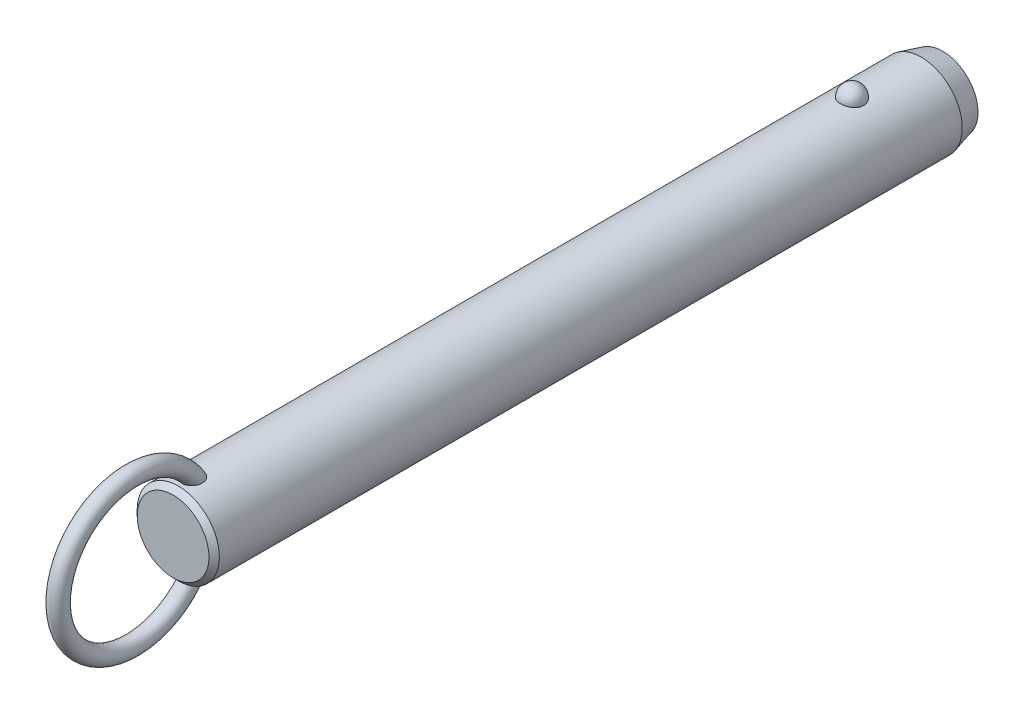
ISO-10303-21;
HEADER;
FILE_DESCRIPTION(('STEP AP214'),'2;1');
FILE_NAME('part.step','',(''),(''),'','','');
FILE_SCHEMA(('AUTOMOTIVE_DESIGN { 1 0 10303 214 1 1 1 1 }'));
ENDSEC;
DATA;
#1=APPLICATION_CONTEXT('core data for automotive mechanical design processes');
#2=APPLICATION_PROTOCOL_DEFINITION('international standard','automotive_design',2000,#1);
#3=PRODUCT_CONTEXT('',#1,'mechanical');
#4=PRODUCT('Part','Part','',(#3));
#5=PRODUCT_RELATED_PRODUCT_CATEGORY('part','',(#4));
#6=PRODUCT_DEFINITION_FORMATION('','',#4);
#7=PRODUCT_DEFINITION_CONTEXT('part definition',#1,'design');
#8=PRODUCT_DEFINITION('design','',#6,#7);
#9=PRODUCT_DEFINITION_SHAPE('','',#8);
#10=(LENGTH_UNIT() NAMED_UNIT(*) SI_UNIT(.MILLI.,.METRE.));
#11=(NAMED_UNIT(*) PLANE_ANGLE_UNIT() SI_UNIT($,.RADIAN.));
#12=(NAMED_UNIT(*) SI_UNIT($,.STERADIAN.) SOLID_ANGLE_UNIT());
#13=UNCERTAINTY_MEASURE_WITH_UNIT(LENGTH_MEASURE(1.E-05),#10,'distance_accuracy_value','');
#14=(GEOMETRIC_REPRESENTATION_CONTEXT(3) GLOBAL_UNCERTAINTY_ASSIGNED_CONTEXT((#13)) GLOBAL_UNIT_ASSIGNED_CONTEXT((#10,
#11,#12)) REPRESENTATION_CONTEXT('',''));
#15=CARTESIAN_POINT('',(0.,0.,0.));
#16=DIRECTION('',(0.,0.,1.));
#17=DIRECTION('',(1.,0.,0.));
#18=AXIS2_PLACEMENT_3D('',#15,#16,#17);
#19=CARTESIAN_POINT('',(0.,0.,144.8));
#20=DIRECTION('',(0.,0.,-1.));
#21=DIRECTION('',(-1.,0.,0.));
#22=AXIS2_PLACEMENT_3D('',#19,#20,#21);
#23=CYLINDRICAL_SURFACE('',#22,9.5);
#24=CARTESIAN_POINT('',(2.67259918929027,9.11631578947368,-2.70000000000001));
#25=CARTESIAN_POINT('',(2.6725968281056,9.11631786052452,-2.54909854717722));
#26=CARTESIAN_POINT('',(2.66030567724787,9.11994722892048,-2.39816735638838));
#27=CARTESIAN_POINT('',(2.6114347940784,9.13405924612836,-2.10058568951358));
#28=CARTESIAN_POINT('',(2.57484658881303,9.14454428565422,-1.95393672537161));
#29=CARTESIAN_POINT('',(2.47830875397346,9.17117631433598,-1.66916069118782));
#30=CARTESIAN_POINT('',(2.41836936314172,9.18732082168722,-1.53102991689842));
#31=CARTESIAN_POINT('',(2.27661331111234,9.22346780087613,-1.26705393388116));
#32=CARTESIAN_POINT('',(2.19479699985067,9.24347021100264,-1.14120852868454));
#33=CARTESIAN_POINT('',(2.01085282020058,9.28522401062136,-0.904632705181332));
#34=CARTESIAN_POINT('',(1.90862396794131,9.30698376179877,-0.793982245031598));
#35=CARTESIAN_POINT('',(1.6867437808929,9.34973971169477,-0.591607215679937));
#36=CARTESIAN_POINT('',(1.56709244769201,9.37073591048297,-0.499882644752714));
#37=CARTESIAN_POINT('',(1.31393976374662,9.40956370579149,-0.338167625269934));
#38=CARTESIAN_POINT('',(1.18048026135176,9.42740444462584,-0.268113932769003));
#39=CARTESIAN_POINT('',(0.903154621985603,9.45799906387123,-0.151390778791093));
#40=CARTESIAN_POINT('',(0.759289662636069,9.47075351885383,-0.10471867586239));
#41=CARTESIAN_POINT('',(0.468074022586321,9.48956256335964,-0.036763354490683));
#42=CARTESIAN_POINT('',(0.320836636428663,9.49573643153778,-0.0150275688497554));
#43=CARTESIAN_POINT('',(0.0246714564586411,9.50112183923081,0.00396199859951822));
#44=CARTESIAN_POINT('',(-0.124256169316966,9.50033406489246,0.00121819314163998));
#45=CARTESIAN_POINT('',(-0.417264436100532,9.4919475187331,-0.0284441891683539));
#46=CARTESIAN_POINT('',(-0.56138413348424,9.48444885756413,-0.0550074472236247));
#47=CARTESIAN_POINT('',(-0.842986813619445,9.46357853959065,-0.131064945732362));
#48=CARTESIAN_POINT('',(-0.980469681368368,9.450206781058,-0.180559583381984));
#49=CARTESIAN_POINT('',(-1.24585005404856,9.41890822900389,-0.301476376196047));
#50=CARTESIAN_POINT('',(-1.37368611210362,9.40095498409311,-0.373026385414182));
#51=CARTESIAN_POINT('',(-1.61552738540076,9.36242964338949,-0.536025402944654));
#52=CARTESIAN_POINT('',(-1.72953116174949,9.34185727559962,-0.627476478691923));
#53=CARTESIAN_POINT('',(-1.9429225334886,9.29984568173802,-0.82984483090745));
#54=CARTESIAN_POINT('',(-2.04198021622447,9.27839736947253,-0.941108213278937));
#55=CARTESIAN_POINT('',(-2.2202646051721,9.23735994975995,-1.17883414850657));
#56=CARTESIAN_POINT('',(-2.29948985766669,9.21777097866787,-1.30529781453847));
#57=CARTESIAN_POINT('',(-2.43697287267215,9.18238994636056,-1.57158566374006));
#58=CARTESIAN_POINT('',(-2.49497068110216,9.16664569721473,-1.71155057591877));
#59=CARTESIAN_POINT('',(-2.5872073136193,9.14104303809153,-1.99961197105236));
#60=CARTESIAN_POINT('',(-2.62144683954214,9.13118445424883,-2.14770821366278));
#61=CARTESIAN_POINT('',(-2.66521466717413,9.11850622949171,-2.44715424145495));
#62=CARTESIAN_POINT('',(-2.67484831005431,9.11565658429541,-2.59848735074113));
#63=CARTESIAN_POINT('',(-2.66946735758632,9.11723375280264,-2.90067317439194));
#64=CARTESIAN_POINT('',(-2.65445345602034,9.12166036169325,-3.05152590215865));
#65=CARTESIAN_POINT('',(-2.60029711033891,9.13724422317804,-3.34766110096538));
#66=CARTESIAN_POINT('',(-2.56127978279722,9.14836656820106,-3.49296833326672));
#67=CARTESIAN_POINT('',(-2.46018844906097,9.17606676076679,-3.77477535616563));
#68=CARTESIAN_POINT('',(-2.39811349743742,9.1926448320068,-3.9112747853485));
#69=CARTESIAN_POINT('',(-2.25202303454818,9.22952198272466,-4.17244273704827));
#70=CARTESIAN_POINT('',(-2.16788714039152,9.24984129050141,-4.29704106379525));
#71=CARTESIAN_POINT('',(-1.97994083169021,9.29188255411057,-4.53013066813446));
#72=CARTESIAN_POINT('',(-1.87612963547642,9.31360456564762,-4.63862130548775));
#73=CARTESIAN_POINT('',(-1.65105429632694,9.35612959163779,-4.8369029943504));
#74=CARTESIAN_POINT('',(-1.52972405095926,9.37692871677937,-4.92661991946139));
#75=CARTESIAN_POINT('',(-1.27318250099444,9.41518970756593,-5.08429106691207));
#76=CARTESIAN_POINT('',(-1.13797219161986,9.432651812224,-5.15224684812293));
#77=CARTESIAN_POINT('',(-0.859280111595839,9.46208255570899,-5.26371827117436));
#78=CARTESIAN_POINT('',(-0.715925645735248,9.47411833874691,-5.30753421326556));
#79=CARTESIAN_POINT('',(-0.423550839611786,9.4916822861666,-5.37076321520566));
#80=CARTESIAN_POINT('',(-0.274531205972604,9.49721125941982,-5.39017930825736));
#81=CARTESIAN_POINT('',(0.0218446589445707,9.50110860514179,-5.40390587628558));
#82=CARTESIAN_POINT('',(0.169177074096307,9.49961381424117,-5.39869609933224));
#83=CARTESIAN_POINT('',(0.460808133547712,9.48993906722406,-5.36441955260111));
#84=CARTESIAN_POINT('',(0.605106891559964,9.48175936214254,-5.33535367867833));
#85=CARTESIAN_POINT('',(0.886027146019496,9.4596376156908,-5.25435587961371));
#86=CARTESIAN_POINT('',(1.02267710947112,9.44571881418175,-5.20251612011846));
#87=CARTESIAN_POINT('',(1.28523827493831,9.41358993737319,-5.07741549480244));
#88=CARTESIAN_POINT('',(1.41114877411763,9.39537958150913,-5.00415322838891));
#89=CARTESIAN_POINT('',(1.65085227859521,9.3562644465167,-4.83684599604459));
#90=CARTESIAN_POINT('',(1.76442346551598,9.33532178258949,-4.74249218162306));
#91=CARTESIAN_POINT('',(1.97425672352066,9.29321198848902,-4.53620389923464));
#92=CARTESIAN_POINT('',(2.07051582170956,9.27204482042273,-4.42426641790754));
#93=CARTESIAN_POINT('',(2.24490086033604,9.23139221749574,-4.18363183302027));
#94=CARTESIAN_POINT('',(2.32267019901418,9.21194380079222,-4.05466990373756));
#95=CARTESIAN_POINT('',(2.45584092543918,9.1773419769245,-3.78517836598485));
#96=CARTESIAN_POINT('',(2.5112497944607,9.16218713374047,-3.64465264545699));
#97=CARTESIAN_POINT('',(2.59380876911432,9.13913522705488,-3.37104301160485));
#98=CARTESIAN_POINT('',(2.62330266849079,9.13064624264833,-3.23871053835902));
#99=CARTESIAN_POINT('',(2.66269870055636,9.11923566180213,-2.9709266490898));
#100=CARTESIAN_POINT('',(2.67260130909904,9.11631393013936,-2.83547530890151));
#101=CARTESIAN_POINT('',(2.67259918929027,9.11631578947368,-2.70000000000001));
#102=B_SPLINE_CURVE_WITH_KNOTS('',3,(#24,#25,#26,#27,#28,#29,#30,#31,#32,#33,#34,#35,#36,#37,
#38,#39,#40,#41,#42,#43,#44,#45,#46,#47,#48,#49,#50,#51,#52,#53,#54,#55,#56,#57,#58,#59,#60,#61,
#62,#63,#64,#65,#66,#67,#68,#69,#70,#71,#72,#73,#74,#75,#76,#77,#78,#79,#80,#81,#82,#83,#84,#85,
#86,#87,#88,#89,#90,#91,#92,#93,#94,#95,#96,#97,#98,#99,#100,#101),.UNSPECIFIED.,.T.,.F.,(4,2,2,
2,2,2,2,2,2,2,2,2,2,2,2,2,2,2,2,2,2,2,2,2,2,2,2,2,2,2,2,2,2,2,2,2,2,2,4),(0.,0.452217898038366,
0.904593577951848,1.35677112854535,1.80894144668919,2.26340676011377,2.71787203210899,
3.17099820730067,3.62407318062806,4.06878835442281,4.51345969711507,4.95160616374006,
5.38976021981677,5.83050358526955,6.27129275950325,6.72071308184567,7.17016633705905,
7.62495278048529,8.07972578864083,8.53254856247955,8.98535859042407,9.43582813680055,
9.88631615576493,10.3393155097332,10.7923328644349,11.2471065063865,11.7018475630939,
12.150795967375,12.599688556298,13.0398725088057,13.4800399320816,13.9184421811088,
14.3568730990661,14.802202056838,15.2476074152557,15.7010097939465,16.1542603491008,
16.5602594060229,16.9662486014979),.UNSPECIFIED.);
#103=CARTESIAN_POINT('',(2.67259918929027,9.11631578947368,-2.70000000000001));
#104=VERTEX_POINT('',#103);
#105=EDGE_CURVE('E41',#104,#104,#102,.T.);
#106=ORIENTED_EDGE('',*,*,#105,.T.);
#107=EDGE_LOOP('',(#106));
#108=FACE_BOUND('',#107,.T.);
#109=CARTESIAN_POINT('',(0.,0.,153.12));
#110=DIRECTION('',(0.,0.,1.));
#111=DIRECTION('',(1.,0.,0.));
#112=AXIS2_PLACEMENT_3D('',#109,#110,#111);
#113=CIRCLE('',#112,9.5);
#114=CARTESIAN_POINT('',(9.5,0.,153.12));
#115=VERTEX_POINT('',#114);
#116=EDGE_CURVE('E10',#115,#115,#113,.F.);
#117=ORIENTED_EDGE('',*,*,#116,.T.);
#118=EDGE_LOOP('',(#117));
#119=FACE_BOUND('',#118,.T.);
#120=CARTESIAN_POINT('',(-0.697062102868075,-9.47439269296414,147.467808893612));
#121=CARTESIAN_POINT('',(-0.799579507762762,-9.46685146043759,147.507482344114));
#122=CARTESIAN_POINT('',(-0.89857563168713,-9.45788043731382,147.5559309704));
#123=CARTESIAN_POINT('',(-1.08670047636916,-9.43811593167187,147.668868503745));
#124=CARTESIAN_POINT('',(-1.17583204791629,-9.42732297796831,147.733352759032));
#125=CARTESIAN_POINT('',(-1.34179806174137,-9.40513672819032,147.876209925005));
#126=CARTESIAN_POINT('',(-1.41865133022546,-9.39374438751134,147.954561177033));
#127=CARTESIAN_POINT('',(-1.5586004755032,-9.37154196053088,148.122752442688));
#128=CARTESIAN_POINT('',(-1.62169476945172,-9.3607319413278,148.21259377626));
#129=CARTESIAN_POINT('',(-1.73527695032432,-9.34035749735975,148.404500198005));
#130=CARTESIAN_POINT('',(-1.7852226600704,-9.33085270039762,148.506891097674));
#131=CARTESIAN_POINT('',(-1.86924997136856,-9.3143834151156,148.718148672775));
#132=CARTESIAN_POINT('',(-1.90332570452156,-9.30741986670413,148.827017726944));
#133=CARTESIAN_POINT('',(-1.95893603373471,-9.29588482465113,149.060473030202));
#134=CARTESIAN_POINT('',(-1.97872420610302,-9.29165182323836,149.185489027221));
#135=CARTESIAN_POINT('',(-2.00062129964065,-9.28695978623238,149.437080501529));
#136=CARTESIAN_POINT('',(-2.00272284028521,-9.28650232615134,149.563656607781));
#137=CARTESIAN_POINT('',(-1.98958876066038,-9.28932750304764,149.836815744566));
#138=CARTESIAN_POINT('',(-1.97143366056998,-9.2932400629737,149.983251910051));
#139=CARTESIAN_POINT('',(-1.91479925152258,-9.30507151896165,150.272062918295));
#140=CARTESIAN_POINT('',(-1.87629122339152,-9.31299607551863,150.414431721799));
#141=CARTESIAN_POINT('',(-1.7722568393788,-9.33340232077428,150.715172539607));
#142=CARTESIAN_POINT('',(-1.70334898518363,-9.34641636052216,150.872369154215));
#143=CARTESIAN_POINT('',(-1.58111062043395,-9.36759153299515,151.097517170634));
#144=CARTESIAN_POINT('',(-1.53721459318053,-9.3749261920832,151.170796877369));
#145=CARTESIAN_POINT('',(-1.44302631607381,-9.38988566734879,151.31307405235));
#146=CARTESIAN_POINT('',(-1.39273721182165,-9.39751033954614,151.382073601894));
#147=CARTESIAN_POINT('',(-1.26775962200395,-9.41530678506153,151.536983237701));
#148=CARTESIAN_POINT('',(-1.19052326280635,-9.42548108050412,151.620871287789));
#149=CARTESIAN_POINT('',(-1.02420241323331,-9.44499825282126,151.776008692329));
#150=CARTESIAN_POINT('',(-0.935139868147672,-9.45434261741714,151.847280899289));
#151=CARTESIAN_POINT('',(-0.766610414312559,-9.46930670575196,151.958695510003));
#152=CARTESIAN_POINT('',(-0.689439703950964,-9.47529223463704,152.002235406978));
#153=CARTESIAN_POINT('',(-0.52894200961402,-9.48560294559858,152.07631336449));
#154=CARTESIAN_POINT('',(-0.445620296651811,-9.48992953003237,152.106862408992));
#155=CARTESIAN_POINT('',(-0.273901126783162,-9.49644161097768,152.152579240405));
#156=CARTESIAN_POINT('',(-0.18546574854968,-9.49860811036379,152.16761059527));
#157=CARTESIAN_POINT('',(-0.00734541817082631,-9.5004135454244,152.180149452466));
#158=CARTESIAN_POINT('',(0.0823387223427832,-9.50005405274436,152.177667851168));
#159=CARTESIAN_POINT('',(0.247679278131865,-9.49708301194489,152.156995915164));
#160=CARTESIAN_POINT('',(0.323620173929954,-9.49477609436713,152.140930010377));
#161=CARTESIAN_POINT('',(0.471981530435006,-9.48855917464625,152.097172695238));
#162=CARTESIAN_POINT('',(0.5444002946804,-9.48464840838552,152.069475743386));
#163=CARTESIAN_POINT('',(0.708947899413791,-9.47398336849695,151.99280266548));
#164=CARTESIAN_POINT('',(0.799149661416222,-9.46671310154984,151.939774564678));
#165=CARTESIAN_POINT('',(0.969783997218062,-9.45076225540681,151.819973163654));
#166=CARTESIAN_POINT('',(1.050194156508,-9.44207854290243,151.753169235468));
#167=CARTESIAN_POINT('',(1.23092343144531,-9.42051459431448,151.580759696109));
#168=CARTESIAN_POINT('',(1.32652499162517,-9.40733378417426,151.47026193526));
#169=CARTESIAN_POINT('',(1.49893121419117,-9.38140745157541,151.235561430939));
#170=CARTESIAN_POINT('',(1.57571616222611,-9.36866239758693,151.111344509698));
#171=CARTESIAN_POINT('',(1.71285426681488,-9.34457644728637,150.849389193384));
#172=CARTESIAN_POINT('',(1.77266365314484,-9.33328726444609,150.71136233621));
#173=CARTESIAN_POINT('',(1.87239208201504,-9.31379209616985,150.428051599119));
#174=CARTESIAN_POINT('',(1.91230158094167,-9.30558759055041,150.282764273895));
#175=CARTESIAN_POINT('',(1.97604189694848,-9.29228394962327,149.962028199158));
#176=CARTESIAN_POINT('',(1.9958743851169,-9.28797202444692,149.785724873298));
#177=CARTESIAN_POINT('',(2.00295708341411,-9.28645519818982,149.432414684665));
#178=CARTESIAN_POINT('',(1.99025930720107,-9.28923895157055,149.255409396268));
#179=CARTESIAN_POINT('',(1.93735479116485,-9.30038134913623,148.956338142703));
#180=CARTESIAN_POINT('',(1.90576827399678,-9.30697680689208,148.832667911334));
#181=CARTESIAN_POINT('',(1.82287484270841,-9.32356855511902,148.592329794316));
#182=CARTESIAN_POINT('',(1.77158213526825,-9.33356239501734,148.475656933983));
#183=CARTESIAN_POINT('',(1.64885744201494,-9.35602275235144,148.252706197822));
#184=CARTESIAN_POINT('',(1.57730995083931,-9.36850332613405,148.146492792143));
#185=CARTESIAN_POINT('',(1.41543264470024,-9.39431873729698,147.949553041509));
#186=CARTESIAN_POINT('',(1.32510883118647,-9.40765330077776,147.858821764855));
#187=CARTESIAN_POINT('',(1.13846223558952,-9.43195720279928,147.705033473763));
#188=CARTESIAN_POINT('',(1.04369890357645,-9.44302894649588,147.640094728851));
#189=CARTESIAN_POINT('',(0.843965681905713,-9.46296805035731,147.528038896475));
#190=CARTESIAN_POINT('',(0.739000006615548,-9.47183631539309,147.480914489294));
#191=CARTESIAN_POINT('',(0.528175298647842,-9.48586140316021,147.408117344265));
#192=CARTESIAN_POINT('',(0.422686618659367,-9.49119633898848,147.38140249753));
#193=CARTESIAN_POINT('',(0.208590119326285,-9.49831365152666,147.346013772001));
#194=CARTESIAN_POINT('',(0.0999817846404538,-9.500095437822,147.337342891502));
#195=CARTESIAN_POINT('',(-0.126104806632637,-9.49988861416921,147.338350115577));
#196=CARTESIAN_POINT('',(-0.24357872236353,-9.49757821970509,147.349594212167));
#197=CARTESIAN_POINT('',(-0.474390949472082,-9.48885165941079,147.393167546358));
#198=CARTESIAN_POINT('',(-0.587729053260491,-9.48243528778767,147.425497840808));
#199=CARTESIAN_POINT('',(-0.697062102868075,-9.47439269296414,147.467808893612));
#200=B_SPLINE_CURVE_WITH_KNOTS('',3,(#120,#121,#122,#123,#124,#125,#126,#127,#128,#129,#130,
#131,#132,#133,#134,#135,#136,#137,#138,#139,#140,#141,#142,#143,#144,#145,#146,#147,#148,#149,
#150,#151,#152,#153,#154,#155,#156,#157,#158,#159,#160,#161,#162,#163,#164,#165,#166,#167,#168,
#169,#170,#171,#172,#173,#174,#175,#176,#177,#178,#179,#180,#181,#182,#183,#184,#185,#186,#187,
#188,#189,#190,#191,#192,#193,#194,#195,#196,#197,#198,#199),.UNSPECIFIED.,.T.,.F.,(4,2,2,2,2,2,
2,2,2,2,2,2,2,2,2,2,2,2,2,2,2,2,2,2,2,2,2,2,2,2,2,2,2,2,2,2,2,2,2,4),(0.,0.330119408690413,
0.6601431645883,0.98965593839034,1.31920659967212,1.66074728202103,2.00241415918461,
2.3808869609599,2.75951768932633,3.20065679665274,3.64242004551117,4.15620996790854,
4.4131416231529,4.66994734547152,5.01228664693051,5.35399933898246,5.6194303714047,
5.88463652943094,6.15215502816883,6.41950709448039,6.65144391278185,6.88349136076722,
7.19641200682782,7.51003602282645,7.94779711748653,8.3860149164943,8.83699707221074,
9.28819530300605,9.81778662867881,10.34653170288,10.7284172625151,11.1100280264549,
11.4938603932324,11.8775702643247,12.2220189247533,12.5663259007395,12.8915939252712,
13.2169159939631,13.5689650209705,13.9210316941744),.UNSPECIFIED.);
#201=CARTESIAN_POINT('',(-0.697062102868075,-9.47439269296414,147.467808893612));
#202=VERTEX_POINT('',#201);
#203=EDGE_CURVE('E60',#202,#202,#200,.T.);
#204=ORIENTED_EDGE('',*,*,#203,.T.);
#205=EDGE_LOOP('',(#204));
#206=FACE_BOUND('',#205,.T.);
#207=CARTESIAN_POINT('',(-0.697062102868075,9.47439269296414,147.467808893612));
#208=CARTESIAN_POINT('',(-0.597792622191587,9.48169483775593,147.42939564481));
#209=CARTESIAN_POINT('',(-0.495106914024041,9.48766580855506,147.399168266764));
#210=CARTESIAN_POINT('',(-0.285876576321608,9.49627648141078,147.356032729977));
#211=CARTESIAN_POINT('',(-0.179324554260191,9.49890941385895,147.343159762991));
#212=CARTESIAN_POINT('',(0.0344157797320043,9.50053798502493,147.335166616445));
#213=CARTESIAN_POINT('',(0.14160360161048,9.49953613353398,147.340034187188));
#214=CARTESIAN_POINT('',(0.353563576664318,9.49401038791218,147.367365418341));
#215=CARTESIAN_POINT('',(0.458336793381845,9.48948807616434,147.38982117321));
#216=CARTESIAN_POINT('',(0.662493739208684,9.4774236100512,147.451671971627));
#217=CARTESIAN_POINT('',(0.761881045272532,9.46988348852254,147.491055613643));
#218=CARTESIAN_POINT('',(0.952608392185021,9.45260382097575,147.585634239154));
#219=CARTESIAN_POINT('',(1.04394806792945,9.44286417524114,147.640829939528));
#220=CARTESIAN_POINT('',(1.21712767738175,9.42211760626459,147.766066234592));
#221=CARTESIAN_POINT('',(1.29885671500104,9.41109835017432,147.836257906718));
#222=CARTESIAN_POINT('',(1.44978975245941,9.38903310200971,147.988980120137));
#223=CARTESIAN_POINT('',(1.51899278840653,9.37798710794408,148.071511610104));
#224=CARTESIAN_POINT('',(1.64602857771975,9.35654375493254,148.249776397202));
#225=CARTESIAN_POINT('',(1.70333052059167,9.34618688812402,148.345891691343));
#226=CARTESIAN_POINT('',(1.80259341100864,9.32755128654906,148.545897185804));
#227=CARTESIAN_POINT('',(1.84454942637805,9.31927322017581,148.649789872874));
#228=CARTESIAN_POINT('',(1.91637039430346,9.30478365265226,148.872213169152));
#229=CARTESIAN_POINT('',(1.944805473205,9.29882552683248,148.991219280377));
#230=CARTESIAN_POINT('',(1.98449865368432,9.29043398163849,149.232143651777));
#231=CARTESIAN_POINT('',(1.99574908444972,9.28800213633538,149.354063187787));
#232=CARTESIAN_POINT('',(2.00275141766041,9.28649645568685,149.616932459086));
#233=CARTESIAN_POINT('',(1.99588238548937,9.28799035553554,149.757952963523));
#234=CARTESIAN_POINT('',(1.96270559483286,9.29505517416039,150.037621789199));
#235=CARTESIAN_POINT('',(1.93637872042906,9.30063010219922,150.176267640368));
#236=CARTESIAN_POINT('',(1.85949176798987,9.31633564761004,150.472561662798));
#237=CARTESIAN_POINT('',(1.80549792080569,9.3270926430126,150.629290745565));
#238=CARTESIAN_POINT('',(1.67376869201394,9.3516306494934,150.932284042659));
#239=CARTESIAN_POINT('',(1.59603181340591,9.36541185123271,151.078547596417));
#240=CARTESIAN_POINT('',(1.4360277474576,9.39110706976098,151.325813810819));
#241=CARTESIAN_POINT('',(1.35831795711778,9.40278656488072,151.429791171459));
#242=CARTESIAN_POINT('',(1.18774483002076,9.42585025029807,151.624534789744));
#243=CARTESIAN_POINT('',(1.09490932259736,9.43723493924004,151.715324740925));
#244=CARTESIAN_POINT('',(0.921110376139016,9.45552616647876,151.85620334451));
#245=CARTESIAN_POINT('',(0.843738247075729,9.46281058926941,151.910656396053));
#246=CARTESIAN_POINT('',(0.681245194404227,9.47589120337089,152.006711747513));
#247=CARTESIAN_POINT('',(0.596135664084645,9.48168953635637,152.048332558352));
#248=CARTESIAN_POINT('',(0.433779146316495,9.49038144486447,152.110089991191));
#249=CARTESIAN_POINT('',(0.357459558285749,9.49359170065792,152.13260136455));
#250=CARTESIAN_POINT('',(0.202074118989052,9.49816761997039,152.164574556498));
#251=CARTESIAN_POINT('',(0.123010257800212,9.49953459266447,152.174045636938));
#252=CARTESIAN_POINT('',(-0.035737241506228,9.50026497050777,152.179114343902));
#253=CARTESIAN_POINT('',(-0.115421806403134,9.49962433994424,152.174684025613));
#254=CARTESIAN_POINT('',(-0.272823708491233,9.49640854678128,152.152296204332));
#255=CARTESIAN_POINT('',(-0.350540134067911,9.4938325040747,152.134332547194));
#256=CARTESIAN_POINT('',(-0.500580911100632,9.48709462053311,152.086802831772));
#257=CARTESIAN_POINT('',(-0.572979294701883,9.48296359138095,152.057461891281));
#258=CARTESIAN_POINT('',(-0.712864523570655,9.47347609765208,151.989008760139));
#259=CARTESIAN_POINT('',(-0.780349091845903,9.46811906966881,151.949892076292));
#260=CARTESIAN_POINT('',(-0.946309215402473,9.45329720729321,151.839432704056));
#261=CARTESIAN_POINT('',(-1.04090230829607,9.44321512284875,151.762329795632));
#262=CARTESIAN_POINT('',(-1.21661929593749,9.42219227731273,151.59409718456));
#263=CARTESIAN_POINT('',(-1.29770519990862,9.41124921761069,151.502929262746));
#264=CARTESIAN_POINT('',(-1.47319646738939,9.38563439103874,151.276162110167));
#265=CARTESIAN_POINT('',(-1.5620887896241,9.37102009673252,151.136289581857));
#266=CARTESIAN_POINT('',(-1.71623987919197,9.34401559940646,150.843950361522));
#267=CARTESIAN_POINT('',(-1.7814786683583,9.33162728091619,150.691473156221));
#268=CARTESIAN_POINT('',(-1.88853837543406,9.31055541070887,150.375647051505));
#269=CARTESIAN_POINT('',(-1.92998995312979,9.30193076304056,150.212168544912));
#270=CARTESIAN_POINT('',(-1.98590726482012,9.29015757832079,149.880526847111));
#271=CARTESIAN_POINT('',(-2.0004070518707,9.2870021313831,149.712369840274));
#272=CARTESIAN_POINT('',(-1.99964701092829,9.28716218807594,149.405080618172));
#273=CARTESIAN_POINT('',(-1.98908145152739,9.28945704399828,149.265936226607));
#274=CARTESIAN_POINT('',(-1.94566294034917,9.29865169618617,148.991153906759));
#275=CARTESIAN_POINT('',(-1.91282062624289,9.30554929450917,148.855514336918));
#276=CARTESIAN_POINT('',(-1.84582133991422,9.31898248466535,148.657802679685));
#277=CARTESIAN_POINT('',(-1.82038084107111,9.32400364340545,148.592583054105));
#278=CARTESIAN_POINT('',(-1.7635051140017,9.33492884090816,148.464903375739));
#279=CARTESIAN_POINT('',(-1.73207305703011,9.34083241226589,148.402441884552));
#280=CARTESIAN_POINT('',(-1.66324243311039,9.35333332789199,148.28094078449));
#281=CARTESIAN_POINT('',(-1.625842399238,9.35993084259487,148.221902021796));
#282=CARTESIAN_POINT('',(-1.54527678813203,9.37356864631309,148.107987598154));
#283=CARTESIAN_POINT('',(-1.50211241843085,9.38060884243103,148.053111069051));
#284=CARTESIAN_POINT('',(-1.37681147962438,9.40004442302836,147.909961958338));
#285=CARTESIAN_POINT('',(-1.28916358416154,9.41261047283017,147.826429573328));
#286=CARTESIAN_POINT('',(-1.09996826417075,9.43658180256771,147.677236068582));
#287=CARTESIAN_POINT('',(-0.998461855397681,9.44799034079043,147.611523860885));
#288=CARTESIAN_POINT('',(-0.860188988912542,9.46103017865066,147.5394367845));
#289=CARTESIAN_POINT('',(-0.828141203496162,9.46389141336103,147.523851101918));
#290=CARTESIAN_POINT('',(-0.763210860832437,9.46934915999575,147.494473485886));
#291=CARTESIAN_POINT('',(-0.730328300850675,9.47194567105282,147.480681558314));
#292=CARTESIAN_POINT('',(-0.697062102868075,9.47439269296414,147.467808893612));
#293=B_SPLINE_CURVE_WITH_KNOTS('',3,(#207,#208,#209,#210,#211,#212,#213,#214,#215,#216,#217,
#218,#219,#220,#221,#222,#223,#224,#225,#226,#227,#228,#229,#230,#231,#232,#233,#234,#235,#236,
#237,#238,#239,#240,#241,#242,#243,#244,#245,#246,#247,#248,#249,#250,#251,#252,#253,#254,#255,
#256,#257,#258,#259,#260,#261,#262,#263,#264,#265,#266,#267,#268,#269,#270,#271,#272,#273,#274,
#275,#276,#277,#278,#279,#280,#281,#282,#283,#284,#285,#286,#287,#288,#289,#290,#291,#292),
.UNSPECIFIED.,.T.,.F.,(4,2,2,2,2,2,2,2,2,2,2,2,2,2,2,2,2,2,2,2,2,2,2,2,2,2,2,2,2,2,2,2,2,2,2,2,
2,2,2,2,2,2,4),(0.,0.319942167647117,0.640532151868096,0.960900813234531,1.28112555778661,
1.60113495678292,1.92115886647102,2.24457323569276,2.56801248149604,2.90371927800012,
3.23953387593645,3.60560313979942,3.97183576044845,4.39383693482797,4.81625324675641,
5.31257045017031,5.80891895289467,6.19868344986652,6.58773876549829,6.87145417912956,
7.15475838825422,7.3926375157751,7.63034760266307,7.86853584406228,8.10683246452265,
8.34063661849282,8.57454843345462,8.93983939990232,9.30614105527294,9.80266668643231,
10.2996107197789,10.8040753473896,11.3079021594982,11.7249776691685,12.1418541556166,
12.3521485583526,12.5623319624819,12.7725671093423,12.9827582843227,13.345827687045,
13.7078449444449,13.8150604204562,13.9222762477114),.UNSPECIFIED.);
#294=CARTESIAN_POINT('',(-0.697062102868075,9.47439269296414,147.467808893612));
#295=VERTEX_POINT('',#294);
#296=EDGE_CURVE('E68',#295,#295,#293,.T.);
#297=ORIENTED_EDGE('',*,*,#296,.T.);
#298=EDGE_LOOP('',(#297));
#299=FACE_BOUND('',#298,.T.);
#300=CARTESIAN_POINT('',(0.,0.,-18.7000000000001));
#301=DIRECTION('',(0.,0.,-1.));
#302=DIRECTION('',(-1.,0.,0.));
#303=AXIS2_PLACEMENT_3D('',#300,#301,#302);
#304=CIRCLE('',#303,9.5);
#305=CARTESIAN_POINT('',(-9.5,0.,-18.7000000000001));
#306=VERTEX_POINT('',#305);
#307=EDGE_CURVE('E57',#306,#306,#304,.F.);
#308=ORIENTED_EDGE('',*,*,#307,.T.);
#309=EDGE_LOOP('',(#308));
#310=FACE_BOUND('',#309,.T.);
#311=ADVANCED_FACE('F37',(#108,#119,#206,#299,#310),#23,.T.);
#312=CARTESIAN_POINT('',(0.,0.,-23.7));
#313=DIRECTION('',(0.,0.,-1.));
#314=DIRECTION('',(-1.,0.,0.));
#315=AXIS2_PLACEMENT_3D('',#312,#313,#314);
#316=PLANE('',#315);
#317=CARTESIAN_POINT('',(0.,0.,-23.7));
#318=DIRECTION('',(0.,0.,-1.));
#319=DIRECTION('',(-1.,0.,0.));
#320=AXIS2_PLACEMENT_3D('',#317,#318,#319);
#321=CIRCLE('',#320,8.1602540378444);
#322=CARTESIAN_POINT('',(-8.1602540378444,0.,-23.7));
#323=VERTEX_POINT('',#322);
#324=EDGE_CURVE('E67',#323,#323,#321,.T.);
#325=ORIENTED_EDGE('',*,*,#324,.T.);
#326=EDGE_LOOP('',(#325));
#327=FACE_BOUND('',#326,.T.);
#328=ADVANCED_FACE('F86',(#327),#316,.T.);
#329=CARTESIAN_POINT('',(0.,0.,-23.7));
#330=DIRECTION('',(0.,0.,1.));
#331=DIRECTION('',(1.,0.,0.));
#332=AXIS2_PLACEMENT_3D('',#329,#330,#331);
#333=CONICAL_SURFACE('',#332,8.1602540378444,0.261799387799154);
#334=ORIENTED_EDGE('',*,*,#307,.F.);
#335=EDGE_LOOP('',(#334));
#336=FACE_BOUND('',#335,.T.);
#337=ORIENTED_EDGE('',*,*,#324,.F.);
#338=EDGE_LOOP('',(#337));
#339=FACE_BOUND('',#338,.T.);
#340=ADVANCED_FACE('F84',(#336,#339),#333,.T.);
#341=CARTESIAN_POINT('',(0.,0.,154.32));
#342=DIRECTION('',(0.,0.,1.));
#343=DIRECTION('',(1.,0.,0.));
#344=AXIS2_PLACEMENT_3D('',#341,#342,#343);
#345=PLANE('',#344);
#346=CARTESIAN_POINT('',(0.,0.,154.32));
#347=DIRECTION('',(0.,0.,1.));
#348=DIRECTION('',(1.,0.,0.));
#349=AXIS2_PLACEMENT_3D('',#346,#347,#348);
#350=CIRCLE('',#349,8.30000000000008);
#351=CARTESIAN_POINT('',(8.30000000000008,0.,154.32));
#352=VERTEX_POINT('',#351);
#353=EDGE_CURVE('E50',#352,#352,#350,.T.);
#354=ORIENTED_EDGE('',*,*,#353,.T.);
#355=EDGE_LOOP('',(#354));
#356=FACE_BOUND('',#355,.T.);
#357=ADVANCED_FACE('F78',(#356),#345,.T.);
#358=CARTESIAN_POINT('',(0.,0.,163.85));
#359=DIRECTION('',(1.,0.,0.));
#360=DIRECTION('',(0.,0.,-1.));
#361=AXIS2_PLACEMENT_3D('',#358,#359,#360);
#362=TOROIDAL_SURFACE('',#361,17.05,2.);
#363=ORIENTED_EDGE('',*,*,#296,.F.);
#364=EDGE_LOOP('',(#363));
#365=FACE_BOUND('',#364,.T.);
#366=ORIENTED_EDGE('',*,*,#203,.F.);
#367=EDGE_LOOP('',(#366));
#368=FACE_BOUND('',#367,.T.);
#369=ADVANCED_FACE('F74',(#365,#368),#362,.T.);
#370=CARTESIAN_POINT('',(0.,0.,154.32));
#371=DIRECTION('',(0.,0.,-1.));
#372=DIRECTION('',(-1.,0.,0.));
#373=AXIS2_PLACEMENT_3D('',#370,#371,#372);
#374=CONICAL_SURFACE('',#373,8.30000000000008,0.785398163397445);
#375=ORIENTED_EDGE('',*,*,#116,.F.);
#376=EDGE_LOOP('',(#375));
#377=FACE_BOUND('',#376,.T.);
#378=ORIENTED_EDGE('',*,*,#353,.F.);
#379=EDGE_LOOP('',(#378));
#380=FACE_BOUND('',#379,.T.);
#381=ADVANCED_FACE('F39',(#377,#380),#374,.T.);
#382=CARTESIAN_POINT('',(0.,9.5,-2.70000000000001));
#383=DIRECTION('',(0.,1.,0.));
#384=DIRECTION('',(0.,0.,-1.));
#385=AXIS2_PLACEMENT_3D('',#382,#383,#384);
#386=SPHERICAL_SURFACE('',#385,2.7);
#387=ORIENTED_EDGE('',*,*,#105,.F.);
#388=EDGE_LOOP('',(#387));
#389=FACE_BOUND('',#388,.T.);
#390=ADVANCED_FACE('F80',(#389),#386,.T.);
#391=CLOSED_SHELL('',(#311,#328,#340,#357,#369,#381,#390));
#392=MANIFOLD_SOLID_BREP('B2',#391);
#393=ADVANCED_BREP_SHAPE_REPRESENTATION('',(#18,#392),#14);
#394=SHAPE_DEFINITION_REPRESENTATION(#9,#393);
ENDSEC;
END-ISO-10303-21;
